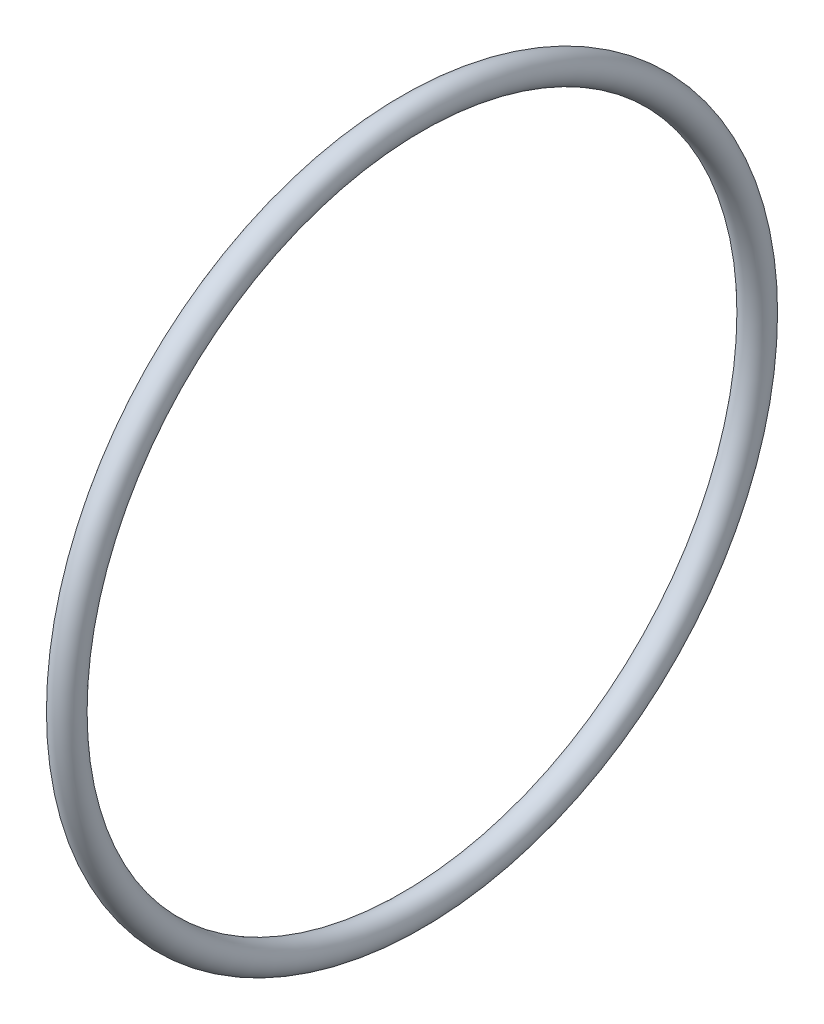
ISO-10303-21;
HEADER;
FILE_DESCRIPTION(('STEP AP214'),'2;1');
FILE_NAME('part.step','',(''),(''),'','','');
FILE_SCHEMA(('AUTOMOTIVE_DESIGN { 1 0 10303 214 1 1 1 1 }'));
ENDSEC;
DATA;
#1=APPLICATION_CONTEXT('core data for automotive mechanical design processes');
#2=APPLICATION_PROTOCOL_DEFINITION('international standard','automotive_design',2000,#1);
#3=PRODUCT_CONTEXT('',#1,'mechanical');
#4=PRODUCT('Part','Part','',(#3));
#5=PRODUCT_RELATED_PRODUCT_CATEGORY('part','',(#4));
#6=PRODUCT_DEFINITION_FORMATION('','',#4);
#7=PRODUCT_DEFINITION_CONTEXT('part definition',#1,'design');
#8=PRODUCT_DEFINITION('design','',#6,#7);
#9=PRODUCT_DEFINITION_SHAPE('','',#8);
#10=(LENGTH_UNIT() NAMED_UNIT(*) SI_UNIT(.MILLI.,.METRE.));
#11=(NAMED_UNIT(*) PLANE_ANGLE_UNIT() SI_UNIT($,.RADIAN.));
#12=(NAMED_UNIT(*) SI_UNIT($,.STERADIAN.) SOLID_ANGLE_UNIT());
#13=UNCERTAINTY_MEASURE_WITH_UNIT(LENGTH_MEASURE(1.E-05),#10,'distance_accuracy_value','');
#14=(GEOMETRIC_REPRESENTATION_CONTEXT(3) GLOBAL_UNCERTAINTY_ASSIGNED_CONTEXT((#13)) GLOBAL_UNIT_ASSIGNED_CONTEXT((#10,
#11,#12)) REPRESENTATION_CONTEXT('',''));
#15=CARTESIAN_POINT('',(0.,0.,0.));
#16=DIRECTION('',(0.,0.,1.));
#17=DIRECTION('',(1.,0.,0.));
#18=AXIS2_PLACEMENT_3D('',#15,#16,#17);
#19=CARTESIAN_POINT('',(0.,0.,0.));
#20=DIRECTION('',(-1.,0.,0.));
#21=DIRECTION('',(0.,0.,1.));
#22=AXIS2_PLACEMENT_3D('',#19,#20,#21);
#23=TOROIDAL_SURFACE('',#22,24.,1.);
#24=CARTESIAN_POINT('',(0.,0.,25.));
#25=VERTEX_POINT('',#24);
#26=VERTEX_LOOP('',#25);
#27=FACE_BOUND('',#26,.T.);
#28=ADVANCED_FACE('F346',(#27),#23,.T.);
#29=CLOSED_SHELL('',(#28));
#30=MANIFOLD_SOLID_BREP('B2',#29);
#31=ADVANCED_BREP_SHAPE_REPRESENTATION('',(#18,#30),#14);
#32=SHAPE_DEFINITION_REPRESENTATION(#9,#31);
ENDSEC;
END-ISO-10303-21;
